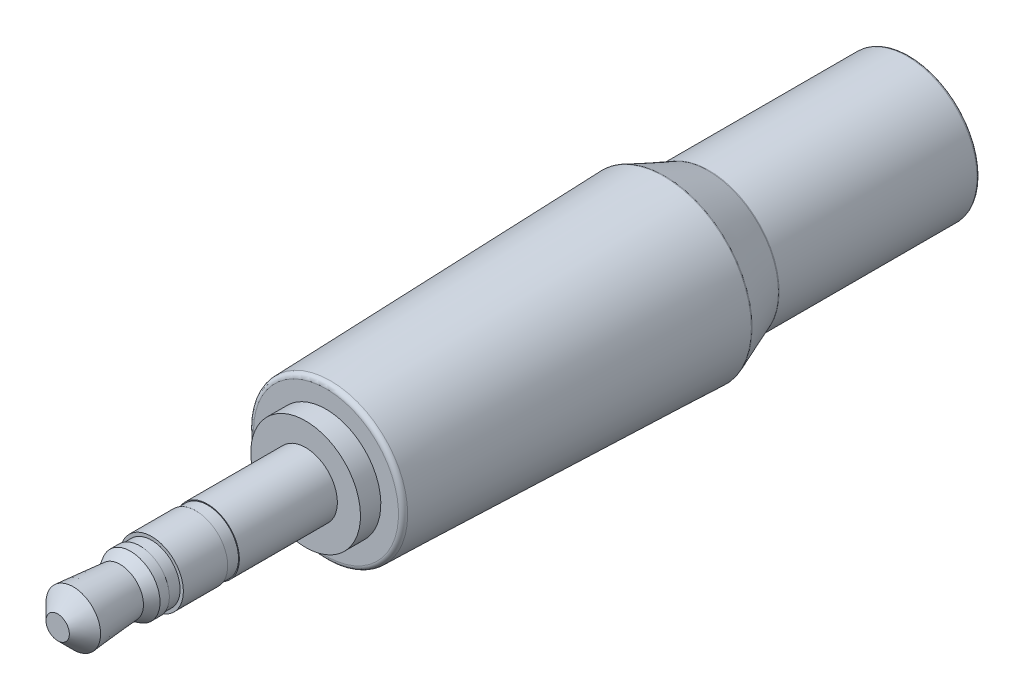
from build123d import *

# Parameters (mm, degrees)
FILLET1_R = 0.254
FILLET2_R = 0.127
FILLET3_R = 0.127
FILLET4_R = 0.127


with BuildPart() as part:
    # Sketch1 → Revolve1 (revolve)
    with BuildSketch(Plane(origin=(0, 0, 0), x_dir=(0, 0, -1), z_dir=(1, 0, 0)), mode=Mode.PRIVATE) as revolve1_sk:
        Polygon((4.479029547, 1.6002), (3.971029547, 1.6002), (3.399106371, 1.27), (0.8509, 1.4859), (0, 0.635), (0, 0), (14.605, 0), (14.605, 2.9845), (13.496029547, 2.9845), (13.496029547, 1.7272), (8.162029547, 1.7272), (8.162029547, 1.68275), (7.527029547, 1.68275), (7.527029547, 1.7272), (5.114029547, 1.7272), (5.114029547, 1.5494), (4.479029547, 1.5494), align=None)
    revolve(revolve1_sk.sketch.rotate(Axis((0, 0, 0), (0, 0, -1)), 180), axis=Axis((0, 0, 0), (0, 0, -1)))

    # Sketch2 → Revolve2 (revolve)
    with BuildSketch(Plane(origin=(0, 0, 0), x_dir=(0, 0, -1), z_dir=(1, 0, 0)), mode=Mode.PRIVATE) as revolve2_sk:
        Polygon((14.605, 0), (14.605, 4.191), (33.02, 4.7625), (35.433, 3.81), (46.355, 3.81), (46.355, 0), align=None)
    revolve(revolve2_sk.sketch.rotate(Axis((0, 0, -14.605), (0, 0, -1)), 90), axis=Axis((0, 0, -14.605), (0, 0, -1)))

    # Fillet1
    fillet1_edges = [part.edges().sort_by_distance(p)[0] for p in [
        (-4.191, 0, -14.605),
    ]]
    fillet(fillet1_edges, radius=FILLET1_R)

    # Fillet2
    fillet2_edges = [part.edges().sort_by_distance(p)[0] for p in [
        (-4.7625, 0, -33.02),
    ]]
    fillet(fillet2_edges, radius=FILLET2_R)

    # Fillet3
    fillet3_edges = [part.edges().sort_by_distance(p)[0] for p in [
        (-3.81, 0, -35.433),
    ]]
    fillet(fillet3_edges, radius=FILLET3_R)

    # Fillet4
    fillet4_edges = [part.edges().sort_by_distance(p)[0] for p in [
        (-3.81, 0, -46.355),
    ]]
    fillet(fillet4_edges, radius=FILLET4_R)


solid = part.part
